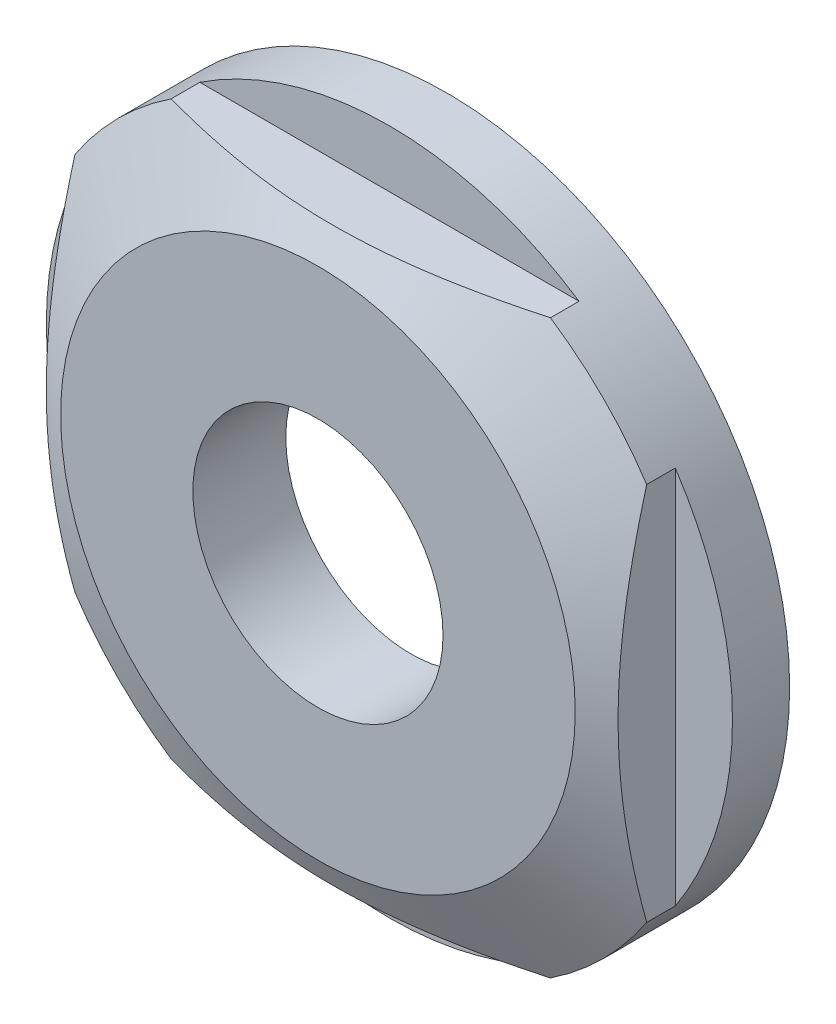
ISO-10303-21;
HEADER;
FILE_DESCRIPTION(('STEP AP214'),'2;1');
FILE_NAME('part.step','',(''),(''),'','','');
FILE_SCHEMA(('AUTOMOTIVE_DESIGN { 1 0 10303 214 1 1 1 1 }'));
ENDSEC;
DATA;
#1=APPLICATION_CONTEXT('core data for automotive mechanical design processes');
#2=APPLICATION_PROTOCOL_DEFINITION('international standard','automotive_design',2000,#1);
#3=PRODUCT_CONTEXT('',#1,'mechanical');
#4=PRODUCT('Part','Part','',(#3));
#5=PRODUCT_RELATED_PRODUCT_CATEGORY('part','',(#4));
#6=PRODUCT_DEFINITION_FORMATION('','',#4);
#7=PRODUCT_DEFINITION_CONTEXT('part definition',#1,'design');
#8=PRODUCT_DEFINITION('design','',#6,#7);
#9=PRODUCT_DEFINITION_SHAPE('','',#8);
#10=(LENGTH_UNIT() NAMED_UNIT(*) SI_UNIT(.MILLI.,.METRE.));
#11=(NAMED_UNIT(*) PLANE_ANGLE_UNIT() SI_UNIT($,.RADIAN.));
#12=(NAMED_UNIT(*) SI_UNIT($,.STERADIAN.) SOLID_ANGLE_UNIT());
#13=UNCERTAINTY_MEASURE_WITH_UNIT(LENGTH_MEASURE(1.E-05),#10,'distance_accuracy_value','');
#14=(GEOMETRIC_REPRESENTATION_CONTEXT(3) GLOBAL_UNCERTAINTY_ASSIGNED_CONTEXT((#13)) GLOBAL_UNIT_ASSIGNED_CONTEXT((#10,
#11,#12)) REPRESENTATION_CONTEXT('',''));
#15=CARTESIAN_POINT('',(0.,0.,0.));
#16=DIRECTION('',(0.,0.,1.));
#17=DIRECTION('',(1.,0.,0.));
#18=AXIS2_PLACEMENT_3D('',#15,#16,#17);
#19=CARTESIAN_POINT('',(0.,0.,0.));
#20=DIRECTION('',(0.,0.,1.));
#21=DIRECTION('',(1.,0.,0.));
#22=AXIS2_PLACEMENT_3D('',#19,#20,#21);
#23=CYLINDRICAL_SURFACE('',#22,8.75);
#24=CARTESIAN_POINT('',(0.,0.,0.));
#25=DIRECTION('',(0.,0.,1.));
#26=DIRECTION('',(1.,0.,0.));
#27=AXIS2_PLACEMENT_3D('',#24,#25,#26);
#28=CIRCLE('',#27,8.75);
#29=CARTESIAN_POINT('',(8.75,0.,0.));
#30=VERTEX_POINT('',#29);
#31=EDGE_CURVE('E132',#30,#30,#28,.T.);
#32=ORIENTED_EDGE('',*,*,#31,.T.);
#33=EDGE_LOOP('',(#32));
#34=FACE_BOUND('',#33,.T.);
#35=CARTESIAN_POINT('',(0.,0.,-6.5));
#36=DIRECTION('',(0.,0.,-1.));
#37=DIRECTION('',(-1.,0.,0.));
#38=AXIS2_PLACEMENT_3D('',#35,#36,#37);
#39=CIRCLE('',#38,8.75);
#40=CARTESIAN_POINT('',(-8.75,0.,-6.5));
#41=VERTEX_POINT('',#40);
#42=EDGE_CURVE('E50',#41,#41,#39,.F.);
#43=ORIENTED_EDGE('',*,*,#42,.F.);
#44=EDGE_LOOP('',(#43));
#45=FACE_BOUND('',#44,.T.);
#46=ADVANCED_FACE('F45',(#34,#45),#23,.F.);
#47=CARTESIAN_POINT('',(0.,0.,-9.));
#48=DIRECTION('',(0.,0.,1.));
#49=DIRECTION('',(1.,0.,0.));
#50=AXIS2_PLACEMENT_3D('',#47,#48,#49);
#51=CYLINDRICAL_SURFACE('',#50,24.);
#52=DIRECTION('',(0.,0.,1.));
#53=VECTOR('',#52,1.);
#54=CARTESIAN_POINT('',(-20.,13.2664991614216,-9.));
#55=LINE('',#54,#53);
#56=CARTESIAN_POINT('',(-20.,13.2664991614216,-3.));
#57=VERTEX_POINT('',#56);
#58=CARTESIAN_POINT('',(-20.,13.2664991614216,-5.));
#59=VERTEX_POINT('',#58);
#60=EDGE_CURVE('E158',#57,#59,#55,.F.);
#61=ORIENTED_EDGE('',*,*,#60,.F.);
#62=CARTESIAN_POINT('',(0.,0.,-3.));
#63=DIRECTION('',(0.,0.,1.));
#64=DIRECTION('',(1.,0.,0.));
#65=AXIS2_PLACEMENT_3D('',#62,#63,#64);
#66=CIRCLE('',#65,24.);
#67=CARTESIAN_POINT('',(-13.2664991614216,20.,-3.));
#68=VERTEX_POINT('',#67);
#69=EDGE_CURVE('E180',#57,#68,#66,.F.);
#70=ORIENTED_EDGE('',*,*,#69,.T.);
#71=DIRECTION('',(0.,0.,1.));
#72=VECTOR('',#71,1.);
#73=CARTESIAN_POINT('',(-13.2664991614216,20.,-9.));
#74=LINE('',#73,#72);
#75=CARTESIAN_POINT('',(-13.2664991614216,20.,-5.));
#76=VERTEX_POINT('',#75);
#77=EDGE_CURVE('E165',#76,#68,#74,.T.);
#78=ORIENTED_EDGE('',*,*,#77,.F.);
#79=CARTESIAN_POINT('',(0.,0.,-5.));
#80=DIRECTION('',(0.,0.,1.));
#81=DIRECTION('',(1.,0.,0.));
#82=AXIS2_PLACEMENT_3D('',#79,#80,#81);
#83=CIRCLE('',#82,24.);
#84=CARTESIAN_POINT('',(13.2664991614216,20.,-5.));
#85=VERTEX_POINT('',#84);
#86=EDGE_CURVE('E192',#76,#85,#83,.F.);
#87=ORIENTED_EDGE('',*,*,#86,.T.);
#88=DIRECTION('',(0.,0.,1.));
#89=VECTOR('',#88,1.);
#90=CARTESIAN_POINT('',(13.2664991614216,20.,-9.));
#91=LINE('',#90,#89);
#92=CARTESIAN_POINT('',(13.2664991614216,20.,-3.));
#93=VERTEX_POINT('',#92);
#94=EDGE_CURVE('E169',#93,#85,#91,.F.);
#95=ORIENTED_EDGE('',*,*,#94,.F.);
#96=CARTESIAN_POINT('',(20.,13.2664991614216,-3.));
#97=VERTEX_POINT('',#96);
#98=EDGE_CURVE('E140',#93,#97,#66,.F.);
#99=ORIENTED_EDGE('',*,*,#98,.T.);
#100=DIRECTION('',(0.,0.,1.));
#101=VECTOR('',#100,1.);
#102=CARTESIAN_POINT('',(20.,13.2664991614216,-9.));
#103=LINE('',#102,#101);
#104=CARTESIAN_POINT('',(20.,13.2664991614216,-5.));
#105=VERTEX_POINT('',#104);
#106=EDGE_CURVE('E127',#105,#97,#103,.T.);
#107=ORIENTED_EDGE('',*,*,#106,.F.);
#108=CARTESIAN_POINT('',(0.,0.,-5.));
#109=DIRECTION('',(0.,0.,1.));
#110=DIRECTION('',(1.,0.,0.));
#111=AXIS2_PLACEMENT_3D('',#108,#109,#110);
#112=CIRCLE('',#111,24.);
#113=CARTESIAN_POINT('',(20.,-13.2664991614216,-5.));
#114=VERTEX_POINT('',#113);
#115=EDGE_CURVE('E115',#105,#114,#112,.F.);
#116=ORIENTED_EDGE('',*,*,#115,.T.);
#117=DIRECTION('',(0.,0.,1.));
#118=VECTOR('',#117,1.);
#119=CARTESIAN_POINT('',(20.,-13.2664991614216,-9.));
#120=LINE('',#119,#118);
#121=CARTESIAN_POINT('',(20.,-13.2664991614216,-3.));
#122=VERTEX_POINT('',#121);
#123=EDGE_CURVE('E129',#122,#114,#120,.F.);
#124=ORIENTED_EDGE('',*,*,#123,.F.);
#125=CARTESIAN_POINT('',(13.2664991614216,-20.,-3.));
#126=VERTEX_POINT('',#125);
#127=EDGE_CURVE('E184',#122,#126,#66,.F.);
#128=ORIENTED_EDGE('',*,*,#127,.T.);
#129=DIRECTION('',(0.,0.,1.));
#130=VECTOR('',#129,1.);
#131=CARTESIAN_POINT('',(13.2664991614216,-20.,-9.));
#132=LINE('',#131,#130);
#133=CARTESIAN_POINT('',(13.2664991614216,-20.,-5.));
#134=VERTEX_POINT('',#133);
#135=EDGE_CURVE('E71',#134,#126,#132,.T.);
#136=ORIENTED_EDGE('',*,*,#135,.F.);
#137=CARTESIAN_POINT('',(0.,0.,-5.));
#138=DIRECTION('',(0.,0.,-1.));
#139=DIRECTION('',(-1.,0.,0.));
#140=AXIS2_PLACEMENT_3D('',#137,#138,#139);
#141=CIRCLE('',#140,24.);
#142=CARTESIAN_POINT('',(-13.2664991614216,-20.,-5.));
#143=VERTEX_POINT('',#142);
#144=EDGE_CURVE('E56',#143,#134,#141,.F.);
#145=ORIENTED_EDGE('',*,*,#144,.F.);
#146=DIRECTION('',(0.,0.,1.));
#147=VECTOR('',#146,1.);
#148=CARTESIAN_POINT('',(-13.2664991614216,-20.,-9.));
#149=LINE('',#148,#147);
#150=CARTESIAN_POINT('',(-13.2664991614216,-20.,-3.));
#151=VERTEX_POINT('',#150);
#152=EDGE_CURVE('E153',#151,#143,#149,.F.);
#153=ORIENTED_EDGE('',*,*,#152,.F.);
#154=CARTESIAN_POINT('',(-20.,-13.2664991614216,-3.));
#155=VERTEX_POINT('',#154);
#156=EDGE_CURVE('E258',#151,#155,#66,.F.);
#157=ORIENTED_EDGE('',*,*,#156,.T.);
#158=DIRECTION('',(0.,0.,1.));
#159=VECTOR('',#158,1.);
#160=CARTESIAN_POINT('',(-20.,-13.2664991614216,-9.));
#161=LINE('',#160,#159);
#162=CARTESIAN_POINT('',(-20.,-13.2664991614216,-5.));
#163=VERTEX_POINT('',#162);
#164=EDGE_CURVE('E63',#163,#155,#161,.T.);
#165=ORIENTED_EDGE('',*,*,#164,.F.);
#166=CARTESIAN_POINT('',(0.,0.,-5.));
#167=DIRECTION('',(0.,0.,1.));
#168=DIRECTION('',(1.,0.,0.));
#169=AXIS2_PLACEMENT_3D('',#166,#167,#168);
#170=CIRCLE('',#169,24.);
#171=EDGE_CURVE('E11',#163,#59,#170,.F.);
#172=ORIENTED_EDGE('',*,*,#171,.T.);
#173=EDGE_LOOP('',(#61,#70,#78,#87,#95,#99,#107,#116,#124,#128,#136,#145,#153,#157,#165,#172));
#174=FACE_BOUND('',#173,.T.);
#175=CARTESIAN_POINT('',(0.,0.,-9.));
#176=DIRECTION('',(0.,0.,1.));
#177=DIRECTION('',(1.,0.,0.));
#178=AXIS2_PLACEMENT_3D('',#175,#176,#177);
#179=CIRCLE('',#178,24.);
#180=CARTESIAN_POINT('',(24.,0.,-9.));
#181=VERTEX_POINT('',#180);
#182=EDGE_CURVE('E172',#181,#181,#179,.T.);
#183=ORIENTED_EDGE('',*,*,#182,.T.);
#184=EDGE_LOOP('',(#183));
#185=FACE_BOUND('',#184,.T.);
#186=ADVANCED_FACE('F136',(#174,#185),#51,.T.);
#187=CARTESIAN_POINT('',(0.,0.,-9.));
#188=DIRECTION('',(0.,0.,1.));
#189=DIRECTION('',(1.,0.,0.));
#190=AXIS2_PLACEMENT_3D('',#187,#188,#189);
#191=PLANE('',#190);
#192=CARTESIAN_POINT('',(0.,0.,-9.));
#193=DIRECTION('',(0.,0.,-1.));
#194=DIRECTION('',(-1.,0.,0.));
#195=AXIS2_PLACEMENT_3D('',#192,#193,#194);
#196=CIRCLE('',#195,17.5);
#197=CARTESIAN_POINT('',(-17.5,0.,-9.));
#198=VERTEX_POINT('',#197);
#199=EDGE_CURVE('E391',#198,#198,#196,.T.);
#200=ORIENTED_EDGE('',*,*,#199,.F.);
#201=EDGE_LOOP('',(#200));
#202=FACE_BOUND('',#201,.T.);
#203=ORIENTED_EDGE('',*,*,#182,.F.);
#204=EDGE_LOOP('',(#203));
#205=FACE_BOUND('',#204,.T.);
#206=ADVANCED_FACE('F202',(#202,#205),#191,.F.);
#207=CARTESIAN_POINT('',(0.,0.,0.));
#208=DIRECTION('',(0.,0.,1.));
#209=DIRECTION('',(1.,0.,0.));
#210=AXIS2_PLACEMENT_3D('',#207,#208,#209);
#211=PLANE('',#210);
#212=ORIENTED_EDGE('',*,*,#31,.F.);
#213=EDGE_LOOP('',(#212));
#214=FACE_BOUND('',#213,.T.);
#215=CARTESIAN_POINT('',(0.,0.,0.));
#216=DIRECTION('',(0.,0.,1.));
#217=DIRECTION('',(1.,0.,0.));
#218=AXIS2_PLACEMENT_3D('',#215,#216,#217);
#219=CIRCLE('',#218,18.);
#220=CARTESIAN_POINT('',(18.,0.,0.));
#221=VERTEX_POINT('',#220);
#222=EDGE_CURVE('E176',#221,#221,#219,.T.);
#223=ORIENTED_EDGE('',*,*,#222,.T.);
#224=EDGE_LOOP('',(#223));
#225=FACE_BOUND('',#224,.T.);
#226=ADVANCED_FACE('F205',(#214,#225),#211,.T.);
#227=CARTESIAN_POINT('',(0.,0.,0.));
#228=DIRECTION('',(0.,0.,-1.));
#229=DIRECTION('',(-1.,0.,0.));
#230=AXIS2_PLACEMENT_3D('',#227,#228,#229);
#231=CONICAL_SURFACE('',#230,18.,1.10714871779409);
#232=CARTESIAN_POINT('',(-20.,-33.2430915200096,-10.3978293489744));
#233=CARTESIAN_POINT('',(-20.,-32.7835784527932,-10.2009598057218));
#234=CARTESIAN_POINT('',(-20.,-32.3236755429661,-10.0050006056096));
#235=CARTESIAN_POINT('',(-20.,-31.4030083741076,-9.61510785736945));
#236=CARTESIAN_POINT('',(-20.,-30.9422441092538,-9.42117432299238));
#237=CARTESIAN_POINT('',(-20.,-29.5584558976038,-8.8426859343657));
#238=CARTESIAN_POINT('',(-20.,-28.6340264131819,-8.46148189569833));
#239=CARTESIAN_POINT('',(-20.,-26.7778782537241,-7.70897016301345));
#240=CARTESIAN_POINT('',(-20.,-25.8461459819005,-7.33769593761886));
#241=CARTESIAN_POINT('',(-20.,-23.9772821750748,-6.60903313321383));
#242=CARTESIAN_POINT('',(-20.,-23.0401508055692,-6.2516441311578));
#243=CARTESIAN_POINT('',(-20.,-21.1571329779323,-5.55355629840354));
#244=CARTESIAN_POINT('',(-20.,-20.2112310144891,-5.21289911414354));
#245=CARTESIAN_POINT('',(-20.,-18.3115379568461,-4.55400442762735));
#246=CARTESIAN_POINT('',(-20.,-17.3577464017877,-4.23576824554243));
#247=CARTESIAN_POINT('',(-20.,-15.4418146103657,-3.62835363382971));
#248=CARTESIAN_POINT('',(-20.,-14.4796824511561,-3.33914990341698));
#249=CARTESIAN_POINT('',(-20.,-12.5450828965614,-2.79763707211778));
#250=CARTESIAN_POINT('',(-20.,-11.5726170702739,-2.54532245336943));
#251=CARTESIAN_POINT('',(-20.,-9.96782944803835,-2.16972777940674));
#252=CARTESIAN_POINT('',(-20.,-9.3387394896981,-2.03264450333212));
#253=CARTESIAN_POINT('',(-20.,-8.0761071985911,-1.78063634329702));
#254=CARTESIAN_POINT('',(-20.,-7.44256494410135,-1.66571107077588));
#255=CARTESIAN_POINT('',(-20.,-6.17162942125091,-1.46096808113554));
#256=CARTESIAN_POINT('',(-20.,-5.53423757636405,-1.371141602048));
#257=CARTESIAN_POINT('',(-20.,-4.25613029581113,-1.21921598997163));
#258=CARTESIAN_POINT('',(-20.,-3.61541489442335,-1.1571165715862));
#259=CARTESIAN_POINT('',(-20.,-2.3331895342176,-1.06283577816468));
#260=CARTESIAN_POINT('',(-20.,-1.69168447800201,-1.03058844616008));
#261=CARTESIAN_POINT('',(-20.,-0.407863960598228,-0.996943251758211));
#262=CARTESIAN_POINT('',(-20.,0.234451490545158,-0.995545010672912));
#263=CARTESIAN_POINT('',(-20.,1.51824026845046,-1.02364533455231));
#264=CARTESIAN_POINT('',(-20.,2.15971376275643,-1.05313634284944));
#265=CARTESIAN_POINT('',(-20.,3.44059627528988,-1.14193404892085));
#266=CARTESIAN_POINT('',(-20.,4.08000521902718,-1.20124181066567));
#267=CARTESIAN_POINT('',(-20.,5.30978943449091,-1.34240860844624));
#268=CARTESIAN_POINT('',(-20.,5.90038868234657,-1.42234247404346));
#269=CARTESIAN_POINT('',(-20.,7.07824531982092,-1.60409885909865));
#270=CARTESIAN_POINT('',(-20.,7.66550237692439,-1.70592351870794));
#271=CARTESIAN_POINT('',(-20.,8.83651113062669,-1.92921254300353));
#272=CARTESIAN_POINT('',(-20.,9.42026117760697,-2.05068549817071));
#273=CARTESIAN_POINT('',(-20.,10.5838602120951,-2.3109159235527));
#274=CARTESIAN_POINT('',(-20.,11.1637092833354,-2.44967302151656));
#275=CARTESIAN_POINT('',(-20.,12.3221468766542,-2.74291973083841));
#276=CARTESIAN_POINT('',(-20.,12.9007182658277,-2.89747669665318));
#277=CARTESIAN_POINT('',(-20.,14.0541675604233,-3.21976749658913));
#278=CARTESIAN_POINT('',(-20.,14.6290454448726,-3.38750140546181));
#279=CARTESIAN_POINT('',(-20.,15.7752410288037,-3.73430503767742));
#280=CARTESIAN_POINT('',(-20.,16.3465593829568,-3.91337260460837));
#281=CARTESIAN_POINT('',(-20.,17.4860234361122,-4.28130080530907));
#282=CARTESIAN_POINT('',(-20.,18.0541691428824,-4.47016141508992));
#283=CARTESIAN_POINT('',(-20.,19.203073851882,-4.8616059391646));
#284=CARTESIAN_POINT('',(-20.,19.7837529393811,-5.06442389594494));
#285=CARTESIAN_POINT('',(-20.,20.9423715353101,-5.47772570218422));
#286=CARTESIAN_POINT('',(-20.,21.5203110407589,-5.6882095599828));
#287=CARTESIAN_POINT('',(-20.,22.673770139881,-6.1158036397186));
#288=CARTESIAN_POINT('',(-20.,23.2492895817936,-6.33291427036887));
#289=CARTESIAN_POINT('',(-20.,24.3981363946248,-6.77286172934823));
#290=CARTESIAN_POINT('',(-20.,24.9714637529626,-6.99569859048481));
#291=CARTESIAN_POINT('',(-20.,26.1097261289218,-7.44381413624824));
#292=CARTESIAN_POINT('',(-20.,26.6746830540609,-7.66903723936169));
#293=CARTESIAN_POINT('',(-20.,27.8028848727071,-8.12373346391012));
#294=CARTESIAN_POINT('',(-20.,28.3661297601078,-8.35320660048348));
#295=CARTESIAN_POINT('',(-20.,29.4909329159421,-8.81581279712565));
#296=CARTESIAN_POINT('',(-20.,30.0524916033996,-9.04894483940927));
#297=CARTESIAN_POINT('',(-20.,31.1742234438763,-9.51849503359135));
#298=CARTESIAN_POINT('',(-20.,31.7343966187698,-9.75491313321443));
#299=CARTESIAN_POINT('',(-20.,32.2939591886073,-9.99276046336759));
#300=B_SPLINE_CURVE_WITH_KNOTS('',3,(#232,#233,#234,#235,#236,#237,#238,#239,#240,#241,#242,
#243,#244,#245,#246,#247,#248,#249,#250,#251,#252,#253,#254,#255,#256,#257,#258,#259,#260,#261,
#262,#263,#264,#265,#266,#267,#268,#269,#270,#271,#272,#273,#274,#275,#276,#277,#278,#279,#280,
#281,#282,#283,#284,#285,#286,#287,#288,#289,#290,#291,#292,#293,#294,#295,#296,#297,#298,#299),
.UNSPECIFIED.,.F.,.F.,(4,2,2,2,2,2,2,2,2,2,2,2,2,2,2,2,2,2,2,2,2,2,2,2,2,2,2,2,2,2,2,2,2,4),(0.,
1.4997277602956,2.99946569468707,5.99923500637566,9.00808941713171,12.0168520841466,
15.0327591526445,18.0488436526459,21.0622764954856,24.0752581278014,26.0064853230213,
27.9376786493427,29.8681969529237,31.7986953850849,33.7249182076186,35.6511173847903,
37.5768454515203,39.5026422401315,41.2901517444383,43.07783608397,44.8663041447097,
46.6547336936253,48.4511331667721,50.2475428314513,52.0436117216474,53.8396762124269,
55.6848535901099,57.5300329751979,59.3753263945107,61.2206303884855,63.0451974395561,
64.8697709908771,66.693845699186,68.5178914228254),.UNSPECIFIED.);
#301=EDGE_CURVE('E123',#155,#57,#300,.T.);
#302=ORIENTED_EDGE('',*,*,#301,.F.);
#303=ORIENTED_EDGE('',*,*,#156,.F.);
#304=CARTESIAN_POINT('',(-36.3598299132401,-20.,-11.7487182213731));
#305=CARTESIAN_POINT('',(-35.8836165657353,-20.,-11.5400934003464));
#306=CARTESIAN_POINT('',(-35.4070557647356,-20.,-11.3322619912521));
#307=CARTESIAN_POINT('',(-34.4531670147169,-20.,-10.918361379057));
#308=CARTESIAN_POINT('',(-33.9758390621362,-20.,-10.712292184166));
#309=CARTESIAN_POINT('',(-32.5425372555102,-20.,-10.0969657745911));
#310=CARTESIAN_POINT('',(-31.5853107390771,-20.,-9.69061839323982));
#311=CARTESIAN_POINT('',(-29.6648468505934,-20.,-8.88663479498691));
#312=CARTESIAN_POINT('',(-28.7016010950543,-20.,-8.48901857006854));
#313=CARTESIAN_POINT('',(-26.7702698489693,-20.,-7.70574881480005));
#314=CARTESIAN_POINT('',(-25.8021844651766,-20.,-7.320095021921));
#315=CARTESIAN_POINT('',(-23.8436718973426,-20.,-6.55744777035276));
#316=CARTESIAN_POINT('',(-22.8531440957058,-20.,-6.18071178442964));
#317=CARTESIAN_POINT('',(-20.8646432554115,-20.,-5.44716753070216));
#318=CARTESIAN_POINT('',(-19.8666698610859,-20.,-5.09036022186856));
#319=CARTESIAN_POINT('',(-17.8623085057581,-20.,-4.40271076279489));
#320=CARTESIAN_POINT('',(-16.8559248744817,-20.,-4.0718560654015));
#321=CARTESIAN_POINT('',(-14.8327298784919,-20.,-3.44368253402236));
#322=CARTESIAN_POINT('',(-13.8159197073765,-20.,-3.14635990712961));
#323=CARTESIAN_POINT('',(-12.117004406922,-20.,-2.68864888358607));
#324=CARTESIAN_POINT('',(-11.438210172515,-20.,-2.51599437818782));
#325=CARTESIAN_POINT('',(-10.0753080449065,-20.,-2.19320786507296));
#326=CARTESIAN_POINT('',(-9.39120064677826,-20.,-2.04307378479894));
#327=CARTESIAN_POINT('',(-8.01793731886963,-20.,-1.76906781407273));
#328=CARTESIAN_POINT('',(-7.3287831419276,-20.,-1.6451872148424));
#329=CARTESIAN_POINT('',(-5.9457157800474,-20.,-1.42737979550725));
#330=CARTESIAN_POINT('',(-5.25180266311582,-20.,-1.33345254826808));
#331=CARTESIAN_POINT('',(-3.86534436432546,-20.,-1.17948447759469));
#332=CARTESIAN_POINT('',(-3.17282658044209,-20.,-1.11919979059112));
#333=CARTESIAN_POINT('',(-1.78561168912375,-20.,-1.03387758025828));
#334=CARTESIAN_POINT('',(-1.09091464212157,-20.,-1.00883908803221));
#335=CARTESIAN_POINT('',(0.298587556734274,-20.,-0.995084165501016));
#336=CARTESIAN_POINT('',(0.993392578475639,-20.,-1.00635459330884));
#337=CARTESIAN_POINT('',(2.38152375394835,-20.,-1.06470703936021));
#338=CARTESIAN_POINT('',(3.0748498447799,-20.,-1.11179055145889));
#339=CARTESIAN_POINT('',(4.21872120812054,-20.,-1.21762890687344));
#340=CARTESIAN_POINT('',(4.67019377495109,-20.,-1.26669526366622));
#341=CARTESIAN_POINT('',(5.57145405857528,-20.,-1.37846972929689));
#342=CARTESIAN_POINT('',(6.02124172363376,-20.,-1.44117825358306));
#343=CARTESIAN_POINT('',(7.36774906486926,-20.,-1.64841071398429));
#344=CARTESIAN_POINT('',(8.26156479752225,-20.,-1.81203688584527));
#345=CARTESIAN_POINT('',(10.0426473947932,-20.,-2.18253160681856));
#346=CARTESIAN_POINT('',(10.929888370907,-20.,-2.3895219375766));
#347=CARTESIAN_POINT('',(12.6953622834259,-20.,-2.83843787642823));
#348=CARTESIAN_POINT('',(13.5735956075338,-20.,-3.08036197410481));
#349=CARTESIAN_POINT('',(15.3486061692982,-20.,-3.60006181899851));
#350=CARTESIAN_POINT('',(16.2451257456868,-20.,-3.87870974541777));
#351=CARTESIAN_POINT('',(18.0305237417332,-20.,-4.45957108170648));
#352=CARTESIAN_POINT('',(18.9194016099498,-20.,-4.76178617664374));
#353=CARTESIAN_POINT('',(20.2444497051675,-20.,-5.22797085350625));
#354=CARTESIAN_POINT('',(20.683120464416,-20.,-5.38489565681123));
#355=CARTESIAN_POINT('',(21.5589665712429,-20.,-5.70287633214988));
#356=CARTESIAN_POINT('',(21.996141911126,-20.,-5.86393222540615));
#357=CARTESIAN_POINT('',(22.8689827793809,-20.,-6.18968408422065));
#358=CARTESIAN_POINT('',(23.3046487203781,-20.,-6.35437894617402));
#359=CARTESIAN_POINT('',(24.1747037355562,-20.,-6.68708086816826));
#360=CARTESIAN_POINT('',(24.6090928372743,-20.,-6.85508785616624));
#361=CARTESIAN_POINT('',(25.0429037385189,-20.,-7.02456729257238));
#362=B_SPLINE_CURVE_WITH_KNOTS('',3,(#304,#305,#306,#307,#308,#309,#310,#311,#312,#313,#314,
#315,#316,#317,#318,#319,#320,#321,#322,#323,#324,#325,#326,#327,#328,#329,#330,#331,#332,#333,
#334,#335,#336,#337,#338,#339,#340,#341,#342,#343,#344,#345,#346,#347,#348,#349,#350,#351,#352,
#353,#354,#355,#356,#357,#358,#359,#360,#361),.UNSPECIFIED.,.F.,.F.,(4,2,2,2,2,2,2,2,2,2,2,2,2,
2,2,2,2,2,2,2,2,2,2,2,2,2,2,2,4),(0.,1.55972016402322,3.11944759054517,6.23911633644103,
9.36530839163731,12.4914317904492,15.6705258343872,18.8497727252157,22.0274729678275,
25.2048134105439,27.3057250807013,29.4064432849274,31.5064635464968,33.6064538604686,
35.6910174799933,37.7755237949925,39.8592757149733,41.9431145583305,43.3053070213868,
44.6675409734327,47.392154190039,50.1245241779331,52.8567760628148,55.6728488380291,
58.4891231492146,59.886790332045,61.2844646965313,62.6817208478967,64.07894664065),.UNSPECIFIED.);
#363=EDGE_CURVE('E241',#126,#151,#362,.F.);
#364=ORIENTED_EDGE('',*,*,#363,.F.);
#365=ORIENTED_EDGE('',*,*,#127,.F.);
#366=CARTESIAN_POINT('',(20.,-35.425157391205,-11.3404878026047));
#367=CARTESIAN_POINT('',(20.,-34.9545807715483,-11.1356008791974));
#368=CARTESIAN_POINT('',(20.,-34.4836455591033,-10.9315378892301));
#369=CARTESIAN_POINT('',(20.,-33.5409832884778,-10.5252426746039));
#370=CARTESIAN_POINT('',(20.,-33.069256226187,-10.3230104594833));
#371=CARTESIAN_POINT('',(20.,-31.6527110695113,-9.71930701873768));
#372=CARTESIAN_POINT('',(20.,-30.7066003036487,-9.32086010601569));
#373=CARTESIAN_POINT('',(20.,-28.8080225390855,-8.53297626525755));
#374=CARTESIAN_POINT('',(20.,-27.8555458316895,-8.14356269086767));
#375=CARTESIAN_POINT('',(20.,-25.9456067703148,-7.37719215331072));
#376=CARTESIAN_POINT('',(20.,-24.9881445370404,-7.00023489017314));
#377=CARTESIAN_POINT('',(20.,-23.0533678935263,-6.25671166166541));
#378=CARTESIAN_POINT('',(20.,-22.0759658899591,-5.89037277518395));
#379=CARTESIAN_POINT('',(20.,-20.1135754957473,-5.17832775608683));
#380=CARTESIAN_POINT('',(20.,-19.1285867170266,-4.83262268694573));
#381=CARTESIAN_POINT('',(20.,-17.1501897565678,-4.1680700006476));
#382=CARTESIAN_POINT('',(20.,-16.156786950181,-3.84920647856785));
#383=CARTESIAN_POINT('',(20.,-14.1595393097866,-3.24601038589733));
#384=CARTESIAN_POINT('',(20.,-13.1556957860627,-2.96167353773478));
#385=CARTESIAN_POINT('',(20.,-11.4860528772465,-2.52835483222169));
#386=CARTESIAN_POINT('',(20.,-10.8235738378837,-2.36659833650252));
#387=CARTESIAN_POINT('',(20.,-9.49351967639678,-2.06543394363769));
#388=CARTESIAN_POINT('',(20.,-8.82594461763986,-1.9260257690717));
#389=CARTESIAN_POINT('',(20.,-7.48612800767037,-1.67306977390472));
#390=CARTESIAN_POINT('',(20.,-6.81388828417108,-1.55951235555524));
#391=CARTESIAN_POINT('',(20.,-5.46508554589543,-1.36160854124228));
#392=CARTESIAN_POINT('',(20.,-4.78852258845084,-1.27726175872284));
#393=CARTESIAN_POINT('',(20.,-3.43652018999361,-1.14118154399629));
#394=CARTESIAN_POINT('',(20.,-2.76110191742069,-1.08924015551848));
#395=CARTESIAN_POINT('',(20.,-1.40850698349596,-1.01912650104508));
#396=CARTESIAN_POINT('',(20.,-0.73133036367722,-1.00095344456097));
#397=CARTESIAN_POINT('',(20.,0.622876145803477,-0.999120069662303));
#398=CARTESIAN_POINT('',(20.,1.29990602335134,-1.01545007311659));
#399=CARTESIAN_POINT('',(20.,2.65232547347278,-1.08193864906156));
#400=CARTESIAN_POINT('',(20.,3.32771497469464,-1.13209866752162));
#401=CARTESIAN_POINT('',(20.,4.45709939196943,-1.24287311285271));
#402=CARTESIAN_POINT('',(20.,4.91196782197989,-1.29484293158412));
#403=CARTESIAN_POINT('',(20.,5.81993676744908,-1.41248533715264));
#404=CARTESIAN_POINT('',(20.,6.27303722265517,-1.47815838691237));
#405=CARTESIAN_POINT('',(20.,7.62938547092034,-1.694311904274));
#406=CARTESIAN_POINT('',(20.,8.52961971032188,-1.86392057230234));
#407=CARTESIAN_POINT('',(20.,10.3233232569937,-2.24622103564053));
#408=CARTESIAN_POINT('',(20.,11.2167666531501,-2.45903181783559));
#409=CARTESIAN_POINT('',(20.,12.9945502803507,-2.91931215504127));
#410=CARTESIAN_POINT('',(20.,13.8788909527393,-3.16678002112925));
#411=CARTESIAN_POINT('',(20.,15.6645653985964,-3.69692541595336));
#412=CARTESIAN_POINT('',(20.,16.5656573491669,-3.98041031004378));
#413=CARTESIAN_POINT('',(20.,18.3602404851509,-4.57057055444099));
#414=CARTESIAN_POINT('',(20.,19.2537311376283,-4.87724751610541));
#415=CARTESIAN_POINT('',(20.,20.5857668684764,-5.34988927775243));
#416=CARTESIAN_POINT('',(20.,21.026790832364,-5.50892779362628));
#417=CARTESIAN_POINT('',(20.,21.9073571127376,-5.83106649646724));
#418=CARTESIAN_POINT('',(20.,22.3468994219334,-5.99416670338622));
#419=CARTESIAN_POINT('',(20.,23.2244923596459,-6.32394565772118));
#420=CARTESIAN_POINT('',(20.,23.6625433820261,-6.49062335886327));
#421=CARTESIAN_POINT('',(20.,24.5373827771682,-6.82723449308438));
#422=CARTESIAN_POINT('',(20.,24.9741711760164,-6.99716785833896));
#423=CARTESIAN_POINT('',(20.,25.4103881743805,-7.16854838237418));
#424=B_SPLINE_CURVE_WITH_KNOTS('',3,(#366,#367,#368,#369,#370,#371,#372,#373,#374,#375,#376,
#377,#378,#379,#380,#381,#382,#383,#384,#385,#386,#387,#388,#389,#390,#391,#392,#393,#394,#395,
#396,#397,#398,#399,#400,#401,#402,#403,#404,#405,#406,#407,#408,#409,#410,#411,#412,#413,#414,
#415,#416,#417,#418,#419,#420,#421,#422,#423),.UNSPECIFIED.,.F.,.F.,(4,2,2,2,2,2,2,2,2,2,2,2,2,
2,2,2,2,2,2,2,2,2,2,2,2,2,2,2,4),(0.,1.53973520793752,3.07947843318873,6.15919824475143,
9.24614966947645,12.333026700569,15.4642498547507,18.5956342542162,21.7251498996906,
24.8542774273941,26.8997844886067,28.9452661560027,30.9899871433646,33.0346810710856,
35.0661147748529,37.0975009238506,39.1283173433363,41.1592205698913,42.5324997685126,
43.9058253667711,46.6526585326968,49.4071622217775,52.161531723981,54.9950414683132,
57.8287482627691,59.2352035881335,60.641665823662,62.0477221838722,63.4537492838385),.UNSPECIFIED.);
#425=EDGE_CURVE('E269',#97,#122,#424,.F.);
#426=ORIENTED_EDGE('',*,*,#425,.F.);
#427=ORIENTED_EDGE('',*,*,#98,.F.);
#428=CARTESIAN_POINT('',(-35.3535736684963,20.,-11.3093277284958));
#429=CARTESIAN_POINT('',(-34.8834198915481,20.,-11.1047251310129));
#430=CARTESIAN_POINT('',(-34.4129066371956,20.,-10.9009489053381));
#431=CARTESIAN_POINT('',(-33.4710863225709,20.,-10.4952326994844));
#432=CARTESIAN_POINT('',(-32.9997792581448,20.,-10.2932927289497));
#433=CARTESIAN_POINT('',(-31.5844904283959,20.,-9.69047497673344));
#434=CARTESIAN_POINT('',(-30.6392128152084,20.,-9.29263066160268));
#435=CARTESIAN_POINT('',(-28.7422738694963,20.,-8.50597601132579));
#436=CARTESIAN_POINT('',(-27.7906027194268,20.,-8.11718930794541));
#437=CARTESIAN_POINT('',(-25.8822632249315,20.,-7.35211206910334));
#438=CARTESIAN_POINT('',(-24.9255950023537,20.,-6.97582123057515));
#439=CARTESIAN_POINT('',(-22.9926014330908,20.,-6.23376650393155));
#440=CARTESIAN_POINT('',(-22.0161895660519,20.,-5.86822714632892));
#441=CARTESIAN_POINT('',(-20.0557685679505,20.,-5.15783726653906));
#442=CARTESIAN_POINT('',(-19.0717590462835,20.,-4.81298781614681));
#443=CARTESIAN_POINT('',(-17.0953207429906,20.,-4.1502170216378));
#444=CARTESIAN_POINT('',(-16.1028974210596,20.,-3.83227949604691));
#445=CARTESIAN_POINT('',(-14.1076084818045,20.,-3.23101371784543));
#446=CARTESIAN_POINT('',(-13.1047441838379,20.,-2.94768114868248));
#447=CARTESIAN_POINT('',(-11.4372731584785,20.,-2.51622876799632));
#448=CARTESIAN_POINT('',(-10.775986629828,20.,-2.35529591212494));
#449=CARTESIAN_POINT('',(-9.44833829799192,20.,-2.05576898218));
#450=CARTESIAN_POINT('',(-8.78197655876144,20.,-1.91717462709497));
#451=CARTESIAN_POINT('',(-7.44461347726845,20.,-1.66581765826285));
#452=CARTESIAN_POINT('',(-6.77361395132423,20.,-1.5530454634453));
#453=CARTESIAN_POINT('',(-5.42732465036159,20.,-1.35665863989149));
#454=CARTESIAN_POINT('',(-4.75203493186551,20.,-1.27304362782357));
#455=CARTESIAN_POINT('',(-3.40256038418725,20.,-1.13833435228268));
#456=CARTESIAN_POINT('',(-2.72839627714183,20.,-1.08703482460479));
#457=CARTESIAN_POINT('',(-1.37834155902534,20.,-1.01809695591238));
#458=CARTESIAN_POINT('',(-0.702450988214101,20.,-1.0004578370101));
#459=CARTESIAN_POINT('',(0.649163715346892,20.,-0.999559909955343));
#460=CARTESIAN_POINT('',(1.32488784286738,20.,-1.01629166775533));
#461=CARTESIAN_POINT('',(2.67468301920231,20.,-1.08343822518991));
#462=CARTESIAN_POINT('',(3.34875399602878,20.,-1.13385446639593));
#463=CARTESIAN_POINT('',(4.47714351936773,20.,-1.24505580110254));
#464=CARTESIAN_POINT('',(4.93233149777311,20.,-1.29727467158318));
#465=CARTESIAN_POINT('',(5.84093231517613,20.,-1.41542199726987));
#466=CARTESIAN_POINT('',(6.29434509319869,20.,-1.48135091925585));
#467=CARTESIAN_POINT('',(7.65162170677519,20.,-1.69827661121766));
#468=CARTESIAN_POINT('',(8.55246238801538,20.,-1.86840600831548));
#469=CARTESIAN_POINT('',(10.3473604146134,20.,-2.25173917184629));
#470=CARTESIAN_POINT('',(11.2413918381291,20.,-2.46506173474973));
#471=CARTESIAN_POINT('',(13.0203426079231,20.,-2.9263456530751));
#472=CARTESIAN_POINT('',(13.905262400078,20.,-3.17430530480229));
#473=CARTESIAN_POINT('',(15.6919726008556,20.,-3.7053847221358));
#474=CARTESIAN_POINT('',(16.5935224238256,20.,-3.98930678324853));
#475=CARTESIAN_POINT('',(18.3890239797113,20.,-4.58031192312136));
#476=CARTESIAN_POINT('',(19.2829751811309,20.,-4.88739660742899));
#477=CARTESIAN_POINT('',(20.6157062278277,20.,-5.36063088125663));
#478=CARTESIAN_POINT('',(21.0569633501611,20.,-5.51986360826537));
#479=CARTESIAN_POINT('',(21.9379969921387,20.,-5.84238517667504));
#480=CARTESIAN_POINT('',(22.3777735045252,20.,-6.00567403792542));
#481=CARTESIAN_POINT('',(23.2558362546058,20.,-6.33582534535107));
#482=CARTESIAN_POINT('',(23.6941228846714,20.,-6.50268674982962));
#483=CARTESIAN_POINT('',(24.5694346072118,20.,-6.83966072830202));
#484=CARTESIAN_POINT('',(25.0064597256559,20.,-7.00977323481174));
#485=CARTESIAN_POINT('',(25.4429139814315,20.,-7.18133084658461));
#486=B_SPLINE_CURVE_WITH_KNOTS('',3,(#428,#429,#430,#431,#432,#433,#434,#435,#436,#437,#438,
#439,#440,#441,#442,#443,#444,#445,#446,#447,#448,#449,#450,#451,#452,#453,#454,#455,#456,#457,
#458,#459,#460,#461,#462,#463,#464,#465,#466,#467,#468,#469,#470,#471,#472,#473,#474,#475,#476,
#477,#478,#479,#480,#481,#482,#483,#484,#485),.UNSPECIFIED.,.F.,.F.,(4,2,2,2,2,2,2,2,2,2,2,2,2,
2,2,2,2,2,2,2,2,2,2,2,2,2,2,2,4),(0.,1.53823164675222,3.0764713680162,6.15318575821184,
9.2371881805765,12.3211157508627,15.4487147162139,18.5764755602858,21.7023421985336,
24.8278185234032,26.8692642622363,28.9106843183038,30.9513456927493,32.9919802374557,
35.0195186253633,37.0470101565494,39.073945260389,41.1009671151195,42.475283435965,
43.8496465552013,46.5985577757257,49.3551347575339,52.1115761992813,54.9467910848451,
57.7822026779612,59.1895137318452,60.5968316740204,62.0037447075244,63.4106285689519),.UNSPECIFIED.);
#487=EDGE_CURVE('E183',#68,#93,#486,.T.);
#488=ORIENTED_EDGE('',*,*,#487,.F.);
#489=ORIENTED_EDGE('',*,*,#69,.F.);
#490=EDGE_LOOP('',(#302,#303,#364,#365,#426,#427,#488,#489));
#491=FACE_BOUND('',#490,.T.);
#492=ORIENTED_EDGE('',*,*,#222,.F.);
#493=EDGE_LOOP('',(#492));
#494=FACE_BOUND('',#493,.T.);
#495=ADVANCED_FACE('F47',(#491,#494),#231,.T.);
#496=CARTESIAN_POINT('',(-16.4872213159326,20.,-5.));
#497=DIRECTION('',(0.,-1.,0.));
#498=DIRECTION('',(0.,0.,-1.));
#499=AXIS2_PLACEMENT_3D('',#496,#497,#498);
#500=PLANE('',#499);
#501=ORIENTED_EDGE('',*,*,#94,.T.);
#502=DIRECTION('',(1.,0.,0.));
#503=VECTOR('',#502,1.);
#504=CARTESIAN_POINT('',(-16.4872213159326,20.,-5.));
#505=LINE('',#504,#503);
#506=EDGE_CURVE('E161',#76,#85,#505,.T.);
#507=ORIENTED_EDGE('',*,*,#506,.F.);
#508=ORIENTED_EDGE('',*,*,#77,.T.);
#509=ORIENTED_EDGE('',*,*,#487,.T.);
#510=EDGE_LOOP('',(#501,#507,#508,#509));
#511=FACE_BOUND('',#510,.T.);
#512=ADVANCED_FACE('F194',(#511),#500,.F.);
#513=CARTESIAN_POINT('',(-16.4872213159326,20.,-5.));
#514=DIRECTION('',(0.,0.,1.));
#515=DIRECTION('',(1.,0.,0.));
#516=AXIS2_PLACEMENT_3D('',#513,#514,#515);
#517=PLANE('',#516);
#518=ORIENTED_EDGE('',*,*,#506,.T.);
#519=ORIENTED_EDGE('',*,*,#86,.F.);
#520=EDGE_LOOP('',(#518,#519));
#521=FACE_BOUND('',#520,.T.);
#522=ADVANCED_FACE('F199',(#521),#517,.T.);
#523=CARTESIAN_POINT('',(20.,18.1402936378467,-5.));
#524=DIRECTION('',(-1.,0.,0.));
#525=DIRECTION('',(0.,-1.,0.));
#526=AXIS2_PLACEMENT_3D('',#523,#524,#525);
#527=PLANE('',#526);
#528=ORIENTED_EDGE('',*,*,#123,.T.);
#529=DIRECTION('',(0.,-1.,0.));
#530=VECTOR('',#529,1.);
#531=CARTESIAN_POINT('',(20.,18.1402936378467,-5.));
#532=LINE('',#531,#530);
#533=EDGE_CURVE('E118',#105,#114,#532,.T.);
#534=ORIENTED_EDGE('',*,*,#533,.F.);
#535=ORIENTED_EDGE('',*,*,#106,.T.);
#536=ORIENTED_EDGE('',*,*,#425,.T.);
#537=EDGE_LOOP('',(#528,#534,#535,#536));
#538=FACE_BOUND('',#537,.T.);
#539=ADVANCED_FACE('F126',(#538),#527,.F.);
#540=CARTESIAN_POINT('',(27.5367047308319,18.1402936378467,-5.));
#541=DIRECTION('',(0.,0.,1.));
#542=DIRECTION('',(1.,0.,0.));
#543=AXIS2_PLACEMENT_3D('',#540,#541,#542);
#544=PLANE('',#543);
#545=ORIENTED_EDGE('',*,*,#533,.T.);
#546=ORIENTED_EDGE('',*,*,#115,.F.);
#547=EDGE_LOOP('',(#545,#546));
#548=FACE_BOUND('',#547,.T.);
#549=ADVANCED_FACE('F117',(#548),#544,.T.);
#550=CARTESIAN_POINT('',(-17.6182707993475,-20.,-5.));
#551=DIRECTION('',(0.,1.,0.));
#552=DIRECTION('',(0.,0.,1.));
#553=AXIS2_PLACEMENT_3D('',#550,#551,#552);
#554=PLANE('',#553);
#555=ORIENTED_EDGE('',*,*,#152,.T.);
#556=DIRECTION('',(-1.,0.,0.));
#557=VECTOR('',#556,1.);
#558=CARTESIAN_POINT('',(-17.6182707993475,-20.,-5.));
#559=LINE('',#558,#557);
#560=EDGE_CURVE('E131',#134,#143,#559,.T.);
#561=ORIENTED_EDGE('',*,*,#560,.F.);
#562=ORIENTED_EDGE('',*,*,#135,.T.);
#563=ORIENTED_EDGE('',*,*,#363,.T.);
#564=EDGE_LOOP('',(#555,#561,#562,#563));
#565=FACE_BOUND('',#564,.T.);
#566=ADVANCED_FACE('F252',(#565),#554,.F.);
#567=CARTESIAN_POINT('',(17.9662860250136,-20.,-5.));
#568=DIRECTION('',(0.,0.,-1.));
#569=DIRECTION('',(-1.,0.,0.));
#570=AXIS2_PLACEMENT_3D('',#567,#568,#569);
#571=PLANE('',#570);
#572=ORIENTED_EDGE('',*,*,#144,.T.);
#573=ORIENTED_EDGE('',*,*,#560,.T.);
#574=EDGE_LOOP('',(#572,#573));
#575=FACE_BOUND('',#574,.T.);
#576=ADVANCED_FACE('F232',(#575),#571,.F.);
#577=CARTESIAN_POINT('',(-20.,17.531266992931,-5.));
#578=DIRECTION('',(1.,0.,0.));
#579=DIRECTION('',(0.,1.,0.));
#580=AXIS2_PLACEMENT_3D('',#577,#578,#579);
#581=PLANE('',#580);
#582=ORIENTED_EDGE('',*,*,#60,.T.);
#583=DIRECTION('',(0.,1.,0.));
#584=VECTOR('',#583,1.);
#585=CARTESIAN_POINT('',(-20.,17.531266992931,-5.));
#586=LINE('',#585,#584);
#587=EDGE_CURVE('E142',#163,#59,#586,.T.);
#588=ORIENTED_EDGE('',*,*,#587,.F.);
#589=ORIENTED_EDGE('',*,*,#164,.T.);
#590=ORIENTED_EDGE('',*,*,#301,.T.);
#591=EDGE_LOOP('',(#582,#588,#589,#590));
#592=FACE_BOUND('',#591,.T.);
#593=ADVANCED_FACE('F227',(#592),#581,.F.);
#594=CARTESIAN_POINT('',(-20.,-14.8341489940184,-5.));
#595=DIRECTION('',(0.,0.,1.));
#596=DIRECTION('',(1.,0.,0.));
#597=AXIS2_PLACEMENT_3D('',#594,#595,#596);
#598=PLANE('',#597);
#599=ORIENTED_EDGE('',*,*,#587,.T.);
#600=ORIENTED_EDGE('',*,*,#171,.F.);
#601=EDGE_LOOP('',(#599,#600));
#602=FACE_BOUND('',#601,.T.);
#603=ADVANCED_FACE('F223',(#602),#598,.T.);
#604=CARTESIAN_POINT('',(0.,0.,-6.5));
#605=DIRECTION('',(0.,0.,-1.));
#606=DIRECTION('',(-1.,0.,0.));
#607=AXIS2_PLACEMENT_3D('',#604,#605,#606);
#608=PLANE('',#607);
#609=CARTESIAN_POINT('',(0.,0.,-6.5));
#610=DIRECTION('',(0.,0.,-1.));
#611=DIRECTION('',(-1.,0.,0.));
#612=AXIS2_PLACEMENT_3D('',#609,#610,#611);
#613=CIRCLE('',#612,17.5);
#614=CARTESIAN_POINT('',(-17.5,0.,-6.5));
#615=VERTEX_POINT('',#614);
#616=EDGE_CURVE('E388',#615,#615,#613,.T.);
#617=ORIENTED_EDGE('',*,*,#616,.T.);
#618=EDGE_LOOP('',(#617));
#619=FACE_BOUND('',#618,.T.);
#620=ORIENTED_EDGE('',*,*,#42,.T.);
#621=EDGE_LOOP('',(#620));
#622=FACE_BOUND('',#621,.T.);
#623=ADVANCED_FACE('F226',(#619,#622),#608,.T.);
#624=CARTESIAN_POINT('',(0.,0.,-6.5));
#625=DIRECTION('',(0.,0.,-1.));
#626=DIRECTION('',(-1.,0.,0.));
#627=AXIS2_PLACEMENT_3D('',#624,#625,#626);
#628=CYLINDRICAL_SURFACE('',#627,17.5);
#629=ORIENTED_EDGE('',*,*,#616,.F.);
#630=EDGE_LOOP('',(#629));
#631=FACE_BOUND('',#630,.T.);
#632=ORIENTED_EDGE('',*,*,#199,.T.);
#633=EDGE_LOOP('',(#632));
#634=FACE_BOUND('',#633,.T.);
#635=ADVANCED_FACE('F221',(#631,#634),#628,.F.);
#636=CLOSED_SHELL('',(#46,#186,#206,#226,#495,#512,#522,#539,#549,#566,#576,#593,#603,#623,#635));
#637=MANIFOLD_SOLID_BREP('B2',#636);
#638=ADVANCED_BREP_SHAPE_REPRESENTATION('',(#18,#637),#14);
#639=SHAPE_DEFINITION_REPRESENTATION(#9,#638);
ENDSEC;
END-ISO-10303-21;
